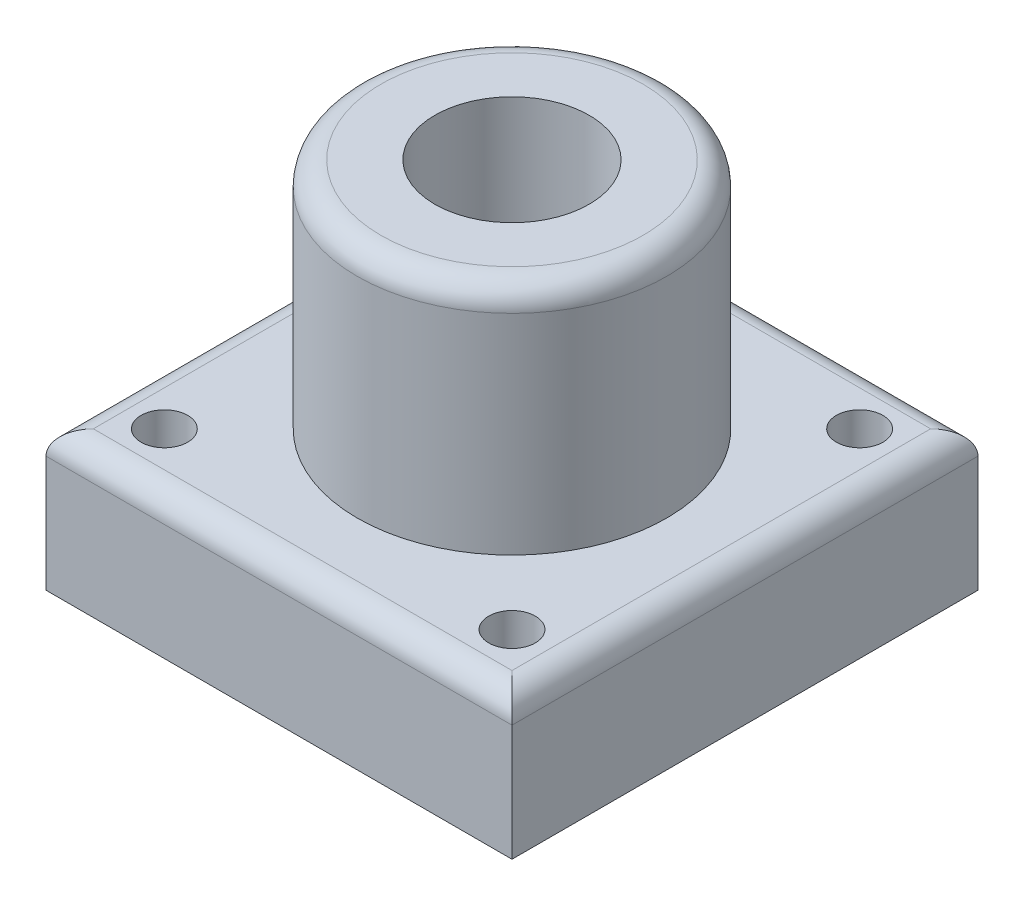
ISO-10303-21;
HEADER;
FILE_DESCRIPTION(('STEP AP214'),'2;1');
FILE_NAME('part.step','',(''),(''),'','','');
FILE_SCHEMA(('AUTOMOTIVE_DESIGN { 1 0 10303 214 1 1 1 1 }'));
ENDSEC;
DATA;
#1=APPLICATION_CONTEXT('core data for automotive mechanical design processes');
#2=APPLICATION_PROTOCOL_DEFINITION('international standard','automotive_design',2000,#1);
#3=PRODUCT_CONTEXT('',#1,'mechanical');
#4=PRODUCT('Part','Part','',(#3));
#5=PRODUCT_RELATED_PRODUCT_CATEGORY('part','',(#4));
#6=PRODUCT_DEFINITION_FORMATION('','',#4);
#7=PRODUCT_DEFINITION_CONTEXT('part definition',#1,'design');
#8=PRODUCT_DEFINITION('design','',#6,#7);
#9=PRODUCT_DEFINITION_SHAPE('','',#8);
#10=(LENGTH_UNIT() NAMED_UNIT(*) SI_UNIT(.MILLI.,.METRE.));
#11=(NAMED_UNIT(*) PLANE_ANGLE_UNIT() SI_UNIT($,.RADIAN.));
#12=(NAMED_UNIT(*) SI_UNIT($,.STERADIAN.) SOLID_ANGLE_UNIT());
#13=UNCERTAINTY_MEASURE_WITH_UNIT(LENGTH_MEASURE(1.E-05),#10,'distance_accuracy_value','');
#14=(GEOMETRIC_REPRESENTATION_CONTEXT(3) GLOBAL_UNCERTAINTY_ASSIGNED_CONTEXT((#13)) GLOBAL_UNIT_ASSIGNED_CONTEXT((#10,
#11,#12)) REPRESENTATION_CONTEXT('',''));
#15=CARTESIAN_POINT('',(0.,0.,0.));
#16=DIRECTION('',(0.,0.,1.));
#17=DIRECTION('',(1.,0.,0.));
#18=AXIS2_PLACEMENT_3D('',#15,#16,#17);
#19=CARTESIAN_POINT('',(-23.8188976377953,15.,-17.8641732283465));
#20=DIRECTION('',(1.,0.,0.));
#21=DIRECTION('',(0.,0.,-1.));
#22=AXIS2_PLACEMENT_3D('',#19,#20,#21);
#23=PLANE('',#22);
#24=DIRECTION('',(0.,-1.,0.));
#25=VECTOR('',#24,1.);
#26=CARTESIAN_POINT('',(-23.8188976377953,15.,32.1358267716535));
#27=LINE('',#26,#25);
#28=CARTESIAN_POINT('',(-23.8188976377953,12.46,32.1358267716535));
#29=VERTEX_POINT('',#28);
#30=CARTESIAN_POINT('',(-23.8188976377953,0.,32.1358267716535));
#31=VERTEX_POINT('',#30);
#32=EDGE_CURVE('E98',#29,#31,#27,.T.);
#33=ORIENTED_EDGE('',*,*,#32,.F.);
#34=DIRECTION('',(0.,0.,1.));
#35=VECTOR('',#34,1.);
#36=CARTESIAN_POINT('',(-23.8188976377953,12.46,-17.8641732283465));
#37=LINE('',#36,#35);
#38=CARTESIAN_POINT('',(-23.8188976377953,12.46,-17.8641732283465));
#39=VERTEX_POINT('',#38);
#40=EDGE_CURVE('E11',#29,#39,#37,.F.);
#41=ORIENTED_EDGE('',*,*,#40,.T.);
#42=DIRECTION('',(0.,-1.,0.));
#43=VECTOR('',#42,1.);
#44=CARTESIAN_POINT('',(-23.8188976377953,15.,-17.8641732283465));
#45=LINE('',#44,#43);
#46=CARTESIAN_POINT('',(-23.8188976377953,0.,-17.8641732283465));
#47=VERTEX_POINT('',#46);
#48=EDGE_CURVE('E120',#39,#47,#45,.T.);
#49=ORIENTED_EDGE('',*,*,#48,.T.);
#50=DIRECTION('',(0.,0.,1.));
#51=VECTOR('',#50,1.);
#52=CARTESIAN_POINT('',(-23.8188976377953,0.,-17.8641732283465));
#53=LINE('',#52,#51);
#54=EDGE_CURVE('E115',#47,#31,#53,.T.);
#55=ORIENTED_EDGE('',*,*,#54,.T.);
#56=EDGE_LOOP('',(#33,#41,#49,#55));
#57=FACE_BOUND('',#56,.T.);
#58=ADVANCED_FACE('F44',(#57),#23,.F.);
#59=CARTESIAN_POINT('',(-23.8188976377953,15.,32.1358267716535));
#60=DIRECTION('',(0.,0.,-1.));
#61=DIRECTION('',(-1.,0.,0.));
#62=AXIS2_PLACEMENT_3D('',#59,#60,#61);
#63=PLANE('',#62);
#64=DIRECTION('',(0.,-1.,0.));
#65=VECTOR('',#64,1.);
#66=CARTESIAN_POINT('',(26.1811023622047,15.,32.1358267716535));
#67=LINE('',#66,#65);
#68=CARTESIAN_POINT('',(26.1811023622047,12.46,32.1358267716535));
#69=VERTEX_POINT('',#68);
#70=CARTESIAN_POINT('',(26.1811023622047,0.,32.1358267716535));
#71=VERTEX_POINT('',#70);
#72=EDGE_CURVE('E109',#69,#71,#67,.T.);
#73=ORIENTED_EDGE('',*,*,#72,.F.);
#74=DIRECTION('',(1.,0.,0.));
#75=VECTOR('',#74,1.);
#76=CARTESIAN_POINT('',(-23.8188976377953,12.46,32.1358267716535));
#77=LINE('',#76,#75);
#78=EDGE_CURVE('E105',#69,#29,#77,.F.);
#79=ORIENTED_EDGE('',*,*,#78,.T.);
#80=ORIENTED_EDGE('',*,*,#32,.T.);
#81=DIRECTION('',(1.,0.,0.));
#82=VECTOR('',#81,1.);
#83=CARTESIAN_POINT('',(-23.8188976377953,0.,32.1358267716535));
#84=LINE('',#83,#82);
#85=EDGE_CURVE('E102',#31,#71,#84,.T.);
#86=ORIENTED_EDGE('',*,*,#85,.T.);
#87=EDGE_LOOP('',(#73,#79,#80,#86));
#88=FACE_BOUND('',#87,.T.);
#89=ADVANCED_FACE('F101',(#88),#63,.F.);
#90=CARTESIAN_POINT('',(26.1811023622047,15.,-17.8641732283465));
#91=DIRECTION('',(-1.,0.,0.));
#92=DIRECTION('',(0.,0.,1.));
#93=AXIS2_PLACEMENT_3D('',#90,#91,#92);
#94=PLANE('',#93);
#95=DIRECTION('',(0.,-1.,0.));
#96=VECTOR('',#95,1.);
#97=CARTESIAN_POINT('',(26.1811023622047,15.,-17.8641732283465));
#98=LINE('',#97,#96);
#99=CARTESIAN_POINT('',(26.1811023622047,12.46,-17.8641732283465));
#100=VERTEX_POINT('',#99);
#101=CARTESIAN_POINT('',(26.1811023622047,0.,-17.8641732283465));
#102=VERTEX_POINT('',#101);
#103=EDGE_CURVE('E139',#100,#102,#98,.T.);
#104=ORIENTED_EDGE('',*,*,#103,.F.);
#105=DIRECTION('',(0.,0.,-1.));
#106=VECTOR('',#105,1.);
#107=CARTESIAN_POINT('',(26.1811023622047,12.46,32.1358267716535));
#108=LINE('',#107,#106);
#109=EDGE_CURVE('E167',#100,#69,#108,.F.);
#110=ORIENTED_EDGE('',*,*,#109,.T.);
#111=ORIENTED_EDGE('',*,*,#72,.T.);
#112=DIRECTION('',(0.,0.,-1.));
#113=VECTOR('',#112,1.);
#114=CARTESIAN_POINT('',(26.1811023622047,0.,-17.8641732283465));
#115=LINE('',#114,#113);
#116=EDGE_CURVE('E117',#71,#102,#115,.T.);
#117=ORIENTED_EDGE('',*,*,#116,.T.);
#118=EDGE_LOOP('',(#104,#110,#111,#117));
#119=FACE_BOUND('',#118,.T.);
#120=ADVANCED_FACE('F258',(#119),#94,.F.);
#121=CARTESIAN_POINT('',(-23.8188976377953,15.,-17.8641732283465));
#122=DIRECTION('',(0.,0.,1.));
#123=DIRECTION('',(1.,0.,0.));
#124=AXIS2_PLACEMENT_3D('',#121,#122,#123);
#125=PLANE('',#124);
#126=ORIENTED_EDGE('',*,*,#48,.F.);
#127=DIRECTION('',(-1.,0.,0.));
#128=VECTOR('',#127,1.);
#129=CARTESIAN_POINT('',(26.1811023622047,12.46,-17.8641732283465));
#130=LINE('',#129,#128);
#131=EDGE_CURVE('E54',#39,#100,#130,.F.);
#132=ORIENTED_EDGE('',*,*,#131,.T.);
#133=ORIENTED_EDGE('',*,*,#103,.T.);
#134=DIRECTION('',(-1.,0.,0.));
#135=VECTOR('',#134,1.);
#136=CARTESIAN_POINT('',(-23.8188976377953,0.,-17.8641732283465));
#137=LINE('',#136,#135);
#138=EDGE_CURVE('E134',#102,#47,#137,.T.);
#139=ORIENTED_EDGE('',*,*,#138,.T.);
#140=EDGE_LOOP('',(#126,#132,#133,#139));
#141=FACE_BOUND('',#140,.T.);
#142=ADVANCED_FACE('F232',(#141),#125,.F.);
#143=CARTESIAN_POINT('',(0.,15.,0.));
#144=DIRECTION('',(0.,1.,0.));
#145=DIRECTION('',(0.,0.,1.));
#146=AXIS2_PLACEMENT_3D('',#143,#144,#145);
#147=PLANE('',#146);
#148=DIRECTION('',(0.,0.,1.));
#149=VECTOR('',#148,1.);
#150=CARTESIAN_POINT('',(-21.2788976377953,15.,32.1358267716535));
#151=LINE('',#150,#149);
#152=CARTESIAN_POINT('',(-21.2788976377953,15.,-15.3241732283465));
#153=VERTEX_POINT('',#152);
#154=CARTESIAN_POINT('',(-21.2788976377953,15.,29.5958267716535));
#155=VERTEX_POINT('',#154);
#156=EDGE_CURVE('E152',#153,#155,#151,.T.);
#157=ORIENTED_EDGE('',*,*,#156,.T.);
#158=DIRECTION('',(1.,0.,0.));
#159=VECTOR('',#158,1.);
#160=CARTESIAN_POINT('',(26.1811023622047,15.,29.5958267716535));
#161=LINE('',#160,#159);
#162=CARTESIAN_POINT('',(23.6411023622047,15.,29.5958267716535));
#163=VERTEX_POINT('',#162);
#164=EDGE_CURVE('E161',#155,#163,#161,.T.);
#165=ORIENTED_EDGE('',*,*,#164,.T.);
#166=DIRECTION('',(0.,0.,-1.));
#167=VECTOR('',#166,1.);
#168=CARTESIAN_POINT('',(23.6411023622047,15.,-17.8641732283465));
#169=LINE('',#168,#167);
#170=CARTESIAN_POINT('',(23.6411023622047,15.,-15.3241732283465));
#171=VERTEX_POINT('',#170);
#172=EDGE_CURVE('E158',#163,#171,#169,.T.);
#173=ORIENTED_EDGE('',*,*,#172,.T.);
#174=DIRECTION('',(-1.,0.,0.));
#175=VECTOR('',#174,1.);
#176=CARTESIAN_POINT('',(-23.8188976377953,15.,-15.3241732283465));
#177=LINE('',#176,#175);
#178=EDGE_CURVE('E155',#171,#153,#177,.T.);
#179=ORIENTED_EDGE('',*,*,#178,.T.);
#180=EDGE_LOOP('',(#157,#165,#173,#179));
#181=FACE_BOUND('',#180,.T.);
#182=CARTESIAN_POINT('',(-17.4688976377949,15.,25.7858268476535));
#183=DIRECTION('',(0.,1.,0.));
#184=DIRECTION('',(0.,0.,1.));
#185=AXIS2_PLACEMENT_3D('',#182,#183,#184);
#186=CIRCLE('',#185,2.5);
#187=CARTESIAN_POINT('',(-17.4688976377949,15.,28.2858268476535));
#188=VERTEX_POINT('',#187);
#189=EDGE_CURVE('E217',#188,#188,#186,.T.);
#190=ORIENTED_EDGE('',*,*,#189,.F.);
#191=EDGE_LOOP('',(#190));
#192=FACE_BOUND('',#191,.T.);
#193=CARTESIAN_POINT('',(19.8311024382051,15.,25.785826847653));
#194=DIRECTION('',(0.,1.,0.));
#195=DIRECTION('',(0.,0.,1.));
#196=AXIS2_PLACEMENT_3D('',#193,#194,#195);
#197=CIRCLE('',#196,2.5);
#198=CARTESIAN_POINT('',(19.8311024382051,15.,28.285826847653));
#199=VERTEX_POINT('',#198);
#200=EDGE_CURVE('E209',#199,#199,#197,.T.);
#201=ORIENTED_EDGE('',*,*,#200,.F.);
#202=EDGE_LOOP('',(#201));
#203=FACE_BOUND('',#202,.T.);
#204=CARTESIAN_POINT('',(19.8311024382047,15.,-11.514173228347));
#205=DIRECTION('',(0.,1.,0.));
#206=DIRECTION('',(0.,0.,1.));
#207=AXIS2_PLACEMENT_3D('',#204,#205,#206);
#208=CIRCLE('',#207,2.5);
#209=CARTESIAN_POINT('',(19.8311024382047,15.,-9.01417322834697));
#210=VERTEX_POINT('',#209);
#211=EDGE_CURVE('E201',#210,#210,#208,.T.);
#212=ORIENTED_EDGE('',*,*,#211,.F.);
#213=EDGE_LOOP('',(#212));
#214=FACE_BOUND('',#213,.T.);
#215=CARTESIAN_POINT('',(-17.4688976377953,15.,-11.5141732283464));
#216=DIRECTION('',(0.,1.,0.));
#217=DIRECTION('',(0.,0.,1.));
#218=AXIS2_PLACEMENT_3D('',#215,#216,#217);
#219=CIRCLE('',#218,2.5);
#220=CARTESIAN_POINT('',(-17.4688976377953,15.,-9.01417322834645));
#221=VERTEX_POINT('',#220);
#222=EDGE_CURVE('E127',#221,#221,#219,.T.);
#223=ORIENTED_EDGE('',*,*,#222,.F.);
#224=EDGE_LOOP('',(#223));
#225=FACE_BOUND('',#224,.T.);
#226=CARTESIAN_POINT('',(1.18110240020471,15.,7.13582677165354));
#227=DIRECTION('',(0.,1.,0.));
#228=DIRECTION('',(0.,0.,1.));
#229=AXIS2_PLACEMENT_3D('',#226,#227,#228);
#230=CIRCLE('',#229,16.6);
#231=CARTESIAN_POINT('',(1.18110240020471,15.,23.7358267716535));
#232=VERTEX_POINT('',#231);
#233=EDGE_CURVE('E108',#232,#232,#230,.T.);
#234=ORIENTED_EDGE('',*,*,#233,.F.);
#235=EDGE_LOOP('',(#234));
#236=FACE_BOUND('',#235,.T.);
#237=ADVANCED_FACE('F229',(#181,#192,#203,#214,#225,#236),#147,.T.);
#238=CARTESIAN_POINT('',(0.,0.,0.));
#239=DIRECTION('',(0.,1.,0.));
#240=DIRECTION('',(0.,0.,1.));
#241=AXIS2_PLACEMENT_3D('',#238,#239,#240);
#242=PLANE('',#241);
#243=CARTESIAN_POINT('',(1.18110240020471,0.,7.13582677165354));
#244=DIRECTION('',(0.,1.,0.));
#245=DIRECTION('',(0.,0.,1.));
#246=AXIS2_PLACEMENT_3D('',#243,#244,#245);
#247=CIRCLE('',#246,8.28);
#248=CARTESIAN_POINT('',(1.18110240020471,0.,15.4158267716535));
#249=VERTEX_POINT('',#248);
#250=EDGE_CURVE('E192',#249,#249,#247,.T.);
#251=ORIENTED_EDGE('',*,*,#250,.T.);
#252=EDGE_LOOP('',(#251));
#253=FACE_BOUND('',#252,.T.);
#254=CARTESIAN_POINT('',(-17.4688976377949,0.,25.7858268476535));
#255=DIRECTION('',(0.,1.,0.));
#256=DIRECTION('',(0.,0.,1.));
#257=AXIS2_PLACEMENT_3D('',#254,#255,#256);
#258=CIRCLE('',#257,2.5);
#259=CARTESIAN_POINT('',(-17.4688976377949,0.,28.2858268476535));
#260=VERTEX_POINT('',#259);
#261=EDGE_CURVE('E198',#260,#260,#258,.T.);
#262=ORIENTED_EDGE('',*,*,#261,.T.);
#263=EDGE_LOOP('',(#262));
#264=FACE_BOUND('',#263,.T.);
#265=CARTESIAN_POINT('',(19.8311024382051,0.,25.785826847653));
#266=DIRECTION('',(0.,1.,0.));
#267=DIRECTION('',(0.,0.,1.));
#268=AXIS2_PLACEMENT_3D('',#265,#266,#267);
#269=CIRCLE('',#268,2.5);
#270=CARTESIAN_POINT('',(19.8311024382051,0.,28.285826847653));
#271=VERTEX_POINT('',#270);
#272=EDGE_CURVE('E213',#271,#271,#269,.T.);
#273=ORIENTED_EDGE('',*,*,#272,.T.);
#274=EDGE_LOOP('',(#273));
#275=FACE_BOUND('',#274,.T.);
#276=CARTESIAN_POINT('',(19.8311024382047,0.,-11.514173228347));
#277=DIRECTION('',(0.,1.,0.));
#278=DIRECTION('',(0.,0.,1.));
#279=AXIS2_PLACEMENT_3D('',#276,#277,#278);
#280=CIRCLE('',#279,2.5);
#281=CARTESIAN_POINT('',(19.8311024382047,0.,-9.01417322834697));
#282=VERTEX_POINT('',#281);
#283=EDGE_CURVE('E205',#282,#282,#280,.T.);
#284=ORIENTED_EDGE('',*,*,#283,.T.);
#285=EDGE_LOOP('',(#284));
#286=FACE_BOUND('',#285,.T.);
#287=CARTESIAN_POINT('',(-17.4688976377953,0.,-11.5141732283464));
#288=DIRECTION('',(0.,1.,0.));
#289=DIRECTION('',(0.,0.,1.));
#290=AXIS2_PLACEMENT_3D('',#287,#288,#289);
#291=CIRCLE('',#290,2.5);
#292=CARTESIAN_POINT('',(-17.4688976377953,0.,-9.01417322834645));
#293=VERTEX_POINT('',#292);
#294=EDGE_CURVE('E123',#293,#293,#291,.T.);
#295=ORIENTED_EDGE('',*,*,#294,.T.);
#296=EDGE_LOOP('',(#295));
#297=FACE_BOUND('',#296,.T.);
#298=ORIENTED_EDGE('',*,*,#54,.F.);
#299=ORIENTED_EDGE('',*,*,#138,.F.);
#300=ORIENTED_EDGE('',*,*,#116,.F.);
#301=ORIENTED_EDGE('',*,*,#85,.F.);
#302=EDGE_LOOP('',(#298,#299,#300,#301));
#303=FACE_BOUND('',#302,.T.);
#304=ADVANCED_FACE('F113',(#253,#264,#275,#286,#297,#303),#242,.F.);
#305=CARTESIAN_POINT('',(1.18110240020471,40.,7.13582677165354));
#306=DIRECTION('',(0.,-1.,0.));
#307=DIRECTION('',(0.,0.,-1.));
#308=AXIS2_PLACEMENT_3D('',#305,#306,#307);
#309=CYLINDRICAL_SURFACE('',#308,16.6);
#310=CARTESIAN_POINT('',(1.18110240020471,37.46,7.13582677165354));
#311=DIRECTION('',(0.,1.,0.));
#312=DIRECTION('',(0.,0.,1.));
#313=AXIS2_PLACEMENT_3D('',#310,#311,#312);
#314=CIRCLE('',#313,16.6);
#315=CARTESIAN_POINT('',(1.18110240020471,37.46,23.7358267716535));
#316=VERTEX_POINT('',#315);
#317=EDGE_CURVE('E148',#316,#316,#314,.F.);
#318=ORIENTED_EDGE('',*,*,#317,.T.);
#319=EDGE_LOOP('',(#318));
#320=FACE_BOUND('',#319,.T.);
#321=ORIENTED_EDGE('',*,*,#233,.T.);
#322=EDGE_LOOP('',(#321));
#323=FACE_BOUND('',#322,.T.);
#324=ADVANCED_FACE('F239',(#320,#323),#309,.T.);
#325=CARTESIAN_POINT('',(1.18110240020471,40.,7.13582677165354));
#326=DIRECTION('',(0.,1.,0.));
#327=DIRECTION('',(0.,0.,1.));
#328=AXIS2_PLACEMENT_3D('',#325,#326,#327);
#329=PLANE('',#328);
#330=CARTESIAN_POINT('',(1.18110240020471,40.,7.13582677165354));
#331=DIRECTION('',(0.,1.,0.));
#332=DIRECTION('',(0.,0.,1.));
#333=AXIS2_PLACEMENT_3D('',#330,#331,#332);
#334=CIRCLE('',#333,14.06);
#335=CARTESIAN_POINT('',(1.18110240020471,40.,21.1958267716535));
#336=VERTEX_POINT('',#335);
#337=EDGE_CURVE('E144',#336,#336,#334,.T.);
#338=ORIENTED_EDGE('',*,*,#337,.T.);
#339=EDGE_LOOP('',(#338));
#340=FACE_BOUND('',#339,.T.);
#341=CARTESIAN_POINT('',(1.18110240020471,40.,7.13582677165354));
#342=DIRECTION('',(0.,1.,0.));
#343=DIRECTION('',(0.,0.,1.));
#344=AXIS2_PLACEMENT_3D('',#341,#342,#343);
#345=CIRCLE('',#344,8.28);
#346=CARTESIAN_POINT('',(1.18110240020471,40.,15.4158267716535));
#347=VERTEX_POINT('',#346);
#348=EDGE_CURVE('E186',#347,#347,#345,.T.);
#349=ORIENTED_EDGE('',*,*,#348,.F.);
#350=EDGE_LOOP('',(#349));
#351=FACE_BOUND('',#350,.T.);
#352=ADVANCED_FACE('F241',(#340,#351),#329,.T.);
#353=CARTESIAN_POINT('',(-17.4688976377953,0.,-11.5141732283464));
#354=DIRECTION('',(0.,1.,0.));
#355=DIRECTION('',(0.,0.,1.));
#356=AXIS2_PLACEMENT_3D('',#353,#354,#355);
#357=CYLINDRICAL_SURFACE('',#356,2.5);
#358=ORIENTED_EDGE('',*,*,#294,.F.);
#359=EDGE_LOOP('',(#358));
#360=FACE_BOUND('',#359,.T.);
#361=ORIENTED_EDGE('',*,*,#222,.T.);
#362=EDGE_LOOP('',(#361));
#363=FACE_BOUND('',#362,.T.);
#364=ADVANCED_FACE('F227',(#360,#363),#357,.F.);
#365=CARTESIAN_POINT('',(19.8311024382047,0.,-11.514173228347));
#366=DIRECTION('',(0.,1.,0.));
#367=DIRECTION('',(0.,0.,1.));
#368=AXIS2_PLACEMENT_3D('',#365,#366,#367);
#369=CYLINDRICAL_SURFACE('',#368,2.5);
#370=ORIENTED_EDGE('',*,*,#283,.F.);
#371=EDGE_LOOP('',(#370));
#372=FACE_BOUND('',#371,.T.);
#373=ORIENTED_EDGE('',*,*,#211,.T.);
#374=EDGE_LOOP('',(#373));
#375=FACE_BOUND('',#374,.T.);
#376=ADVANCED_FACE('F293',(#372,#375),#369,.F.);
#377=CARTESIAN_POINT('',(19.8311024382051,0.,25.785826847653));
#378=DIRECTION('',(0.,1.,0.));
#379=DIRECTION('',(0.,0.,1.));
#380=AXIS2_PLACEMENT_3D('',#377,#378,#379);
#381=CYLINDRICAL_SURFACE('',#380,2.5);
#382=ORIENTED_EDGE('',*,*,#272,.F.);
#383=EDGE_LOOP('',(#382));
#384=FACE_BOUND('',#383,.T.);
#385=ORIENTED_EDGE('',*,*,#200,.T.);
#386=EDGE_LOOP('',(#385));
#387=FACE_BOUND('',#386,.T.);
#388=ADVANCED_FACE('F295',(#384,#387),#381,.F.);
#389=CARTESIAN_POINT('',(-17.4688976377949,0.,25.7858268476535));
#390=DIRECTION('',(0.,1.,0.));
#391=DIRECTION('',(0.,0.,1.));
#392=AXIS2_PLACEMENT_3D('',#389,#390,#391);
#393=CYLINDRICAL_SURFACE('',#392,2.5);
#394=ORIENTED_EDGE('',*,*,#261,.F.);
#395=EDGE_LOOP('',(#394));
#396=FACE_BOUND('',#395,.T.);
#397=ORIENTED_EDGE('',*,*,#189,.T.);
#398=EDGE_LOOP('',(#397));
#399=FACE_BOUND('',#398,.T.);
#400=ADVANCED_FACE('F302',(#396,#399),#393,.F.);
#401=CARTESIAN_POINT('',(1.18110240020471,0.,7.13582677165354));
#402=DIRECTION('',(0.,1.,0.));
#403=DIRECTION('',(0.,0.,1.));
#404=AXIS2_PLACEMENT_3D('',#401,#402,#403);
#405=CYLINDRICAL_SURFACE('',#404,8.28);
#406=ORIENTED_EDGE('',*,*,#250,.F.);
#407=EDGE_LOOP('',(#406));
#408=FACE_BOUND('',#407,.T.);
#409=ORIENTED_EDGE('',*,*,#348,.T.);
#410=EDGE_LOOP('',(#409));
#411=FACE_BOUND('',#410,.T.);
#412=ADVANCED_FACE('F265',(#408,#411),#405,.F.);
#413=CARTESIAN_POINT('',(1.18110240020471,37.46,7.13582677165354));
#414=DIRECTION('',(0.,1.,0.));
#415=DIRECTION('',(0.,0.,1.));
#416=AXIS2_PLACEMENT_3D('',#413,#414,#415);
#417=TOROIDAL_SURFACE('',#416,14.06,2.54);
#418=ORIENTED_EDGE('',*,*,#317,.F.);
#419=EDGE_LOOP('',(#418));
#420=FACE_BOUND('',#419,.T.);
#421=ORIENTED_EDGE('',*,*,#337,.F.);
#422=EDGE_LOOP('',(#421));
#423=FACE_BOUND('',#422,.T.);
#424=ADVANCED_FACE('F262',(#420,#423),#417,.T.);
#425=CARTESIAN_POINT('',(0.,12.46,-15.3241732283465));
#426=DIRECTION('',(1.,0.,0.));
#427=DIRECTION('',(0.,0.,-1.));
#428=AXIS2_PLACEMENT_3D('',#425,#426,#427);
#429=CYLINDRICAL_SURFACE('',#428,2.54);
#430=CARTESIAN_POINT('',(23.6411023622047,12.46,-15.3241732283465));
#431=DIRECTION('',(0.707106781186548,0.,0.707106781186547));
#432=DIRECTION('',(0.707106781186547,0.,-0.707106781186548));
#433=AXIS2_PLACEMENT_3D('',#430,#431,#432);
#434=ELLIPSE('',#433,3.59210244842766,2.54);
#435=EDGE_CURVE('E177',#100,#171,#434,.T.);
#436=ORIENTED_EDGE('',*,*,#435,.F.);
#437=ORIENTED_EDGE('',*,*,#131,.F.);
#438=CARTESIAN_POINT('',(-21.2788976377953,12.46,-15.3241732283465));
#439=DIRECTION('',(0.707106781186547,0.,-0.707106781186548));
#440=DIRECTION('',(-0.707106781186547,0.,-0.707106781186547));
#441=AXIS2_PLACEMENT_3D('',#438,#439,#440);
#442=ELLIPSE('',#441,3.59210244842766,2.54);
#443=EDGE_CURVE('E48',#153,#39,#442,.F.);
#444=ORIENTED_EDGE('',*,*,#443,.F.);
#445=ORIENTED_EDGE('',*,*,#178,.F.);
#446=EDGE_LOOP('',(#436,#437,#444,#445));
#447=FACE_BOUND('',#446,.T.);
#448=ADVANCED_FACE('F46',(#447),#429,.T.);
#449=CARTESIAN_POINT('',(-21.2788976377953,12.46,0.));
#450=DIRECTION('',(0.,0.,-1.));
#451=DIRECTION('',(-1.,0.,0.));
#452=AXIS2_PLACEMENT_3D('',#449,#450,#451);
#453=CYLINDRICAL_SURFACE('',#452,2.54);
#454=ORIENTED_EDGE('',*,*,#443,.T.);
#455=ORIENTED_EDGE('',*,*,#40,.F.);
#456=CARTESIAN_POINT('',(-21.2788976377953,12.46,29.5958267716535));
#457=DIRECTION('',(-0.707106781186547,0.,-0.707106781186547));
#458=DIRECTION('',(0.707106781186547,0.,-0.707106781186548));
#459=AXIS2_PLACEMENT_3D('',#456,#457,#458);
#460=ELLIPSE('',#459,3.59210244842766,2.54);
#461=EDGE_CURVE('E175',#155,#29,#460,.F.);
#462=ORIENTED_EDGE('',*,*,#461,.F.);
#463=ORIENTED_EDGE('',*,*,#156,.F.);
#464=EDGE_LOOP('',(#454,#455,#462,#463));
#465=FACE_BOUND('',#464,.T.);
#466=ADVANCED_FACE('F273',(#465),#453,.T.);
#467=CARTESIAN_POINT('',(23.6411023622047,12.46,0.));
#468=DIRECTION('',(0.,0.,1.));
#469=DIRECTION('',(1.,0.,0.));
#470=AXIS2_PLACEMENT_3D('',#467,#468,#469);
#471=CYLINDRICAL_SURFACE('',#470,2.54);
#472=ORIENTED_EDGE('',*,*,#435,.T.);
#473=ORIENTED_EDGE('',*,*,#172,.F.);
#474=CARTESIAN_POINT('',(23.6411023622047,12.46,29.5958267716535));
#475=DIRECTION('',(-0.707106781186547,0.,0.707106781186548));
#476=DIRECTION('',(0.707106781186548,0.,0.707106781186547));
#477=AXIS2_PLACEMENT_3D('',#474,#475,#476);
#478=ELLIPSE('',#477,3.59210244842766,2.54);
#479=EDGE_CURVE('E172',#69,#163,#478,.T.);
#480=ORIENTED_EDGE('',*,*,#479,.F.);
#481=ORIENTED_EDGE('',*,*,#109,.F.);
#482=EDGE_LOOP('',(#472,#473,#480,#481));
#483=FACE_BOUND('',#482,.T.);
#484=ADVANCED_FACE('F270',(#483),#471,.T.);
#485=CARTESIAN_POINT('',(0.,12.46,29.5958267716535));
#486=DIRECTION('',(-1.,0.,0.));
#487=DIRECTION('',(0.,0.,1.));
#488=AXIS2_PLACEMENT_3D('',#485,#486,#487);
#489=CYLINDRICAL_SURFACE('',#488,2.54);
#490=ORIENTED_EDGE('',*,*,#461,.T.);
#491=ORIENTED_EDGE('',*,*,#78,.F.);
#492=ORIENTED_EDGE('',*,*,#479,.T.);
#493=ORIENTED_EDGE('',*,*,#164,.F.);
#494=EDGE_LOOP('',(#490,#491,#492,#493));
#495=FACE_BOUND('',#494,.T.);
#496=ADVANCED_FACE('F267',(#495),#489,.T.);
#497=CLOSED_SHELL('',(#58,#89,#120,#142,#237,#304,#324,#352,#364,#376,#388,#400,#412,#424,#448,
#466,#484,#496));
#498=MANIFOLD_SOLID_BREP('B2',#497);
#499=ADVANCED_BREP_SHAPE_REPRESENTATION('',(#18,#498),#14);
#500=SHAPE_DEFINITION_REPRESENTATION(#9,#499);
ENDSEC;
END-ISO-10303-21;
